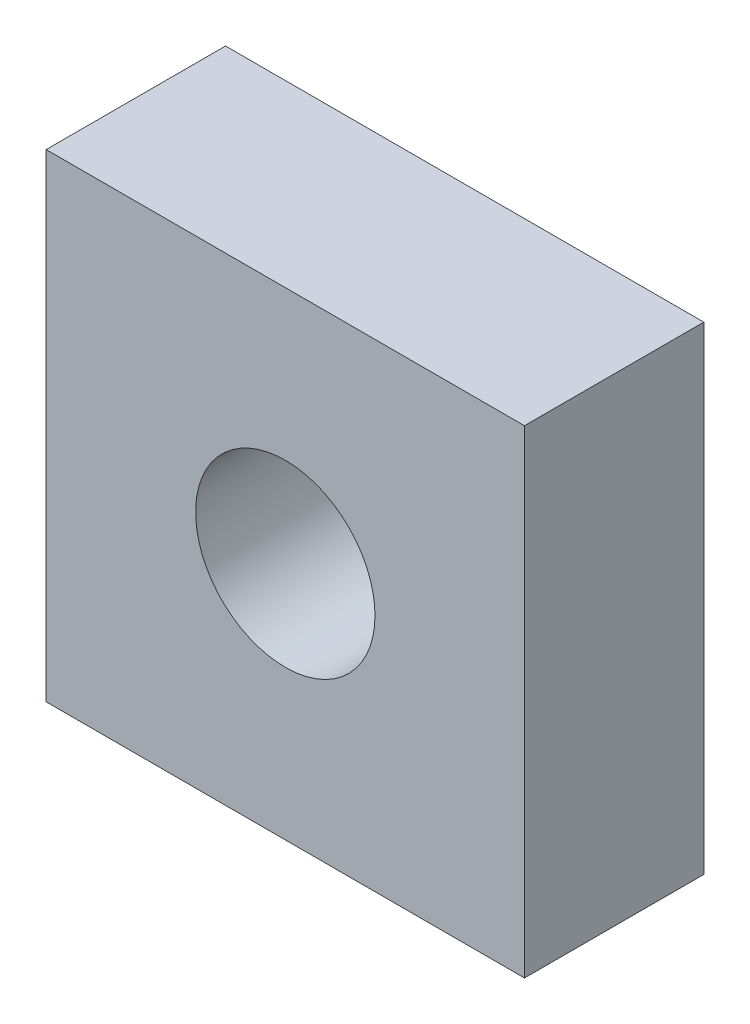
ISO-10303-21;
HEADER;
FILE_DESCRIPTION(('STEP AP214'),'2;1');
FILE_NAME('part.step','',(''),(''),'','','');
FILE_SCHEMA(('AUTOMOTIVE_DESIGN { 1 0 10303 214 1 1 1 1 }'));
ENDSEC;
DATA;
#1=APPLICATION_CONTEXT('core data for automotive mechanical design processes');
#2=APPLICATION_PROTOCOL_DEFINITION('international standard','automotive_design',2000,#1);
#3=PRODUCT_CONTEXT('',#1,'mechanical');
#4=PRODUCT('Part','Part','',(#3));
#5=PRODUCT_RELATED_PRODUCT_CATEGORY('part','',(#4));
#6=PRODUCT_DEFINITION_FORMATION('','',#4);
#7=PRODUCT_DEFINITION_CONTEXT('part definition',#1,'design');
#8=PRODUCT_DEFINITION('design','',#6,#7);
#9=PRODUCT_DEFINITION_SHAPE('','',#8);
#10=(LENGTH_UNIT() NAMED_UNIT(*) SI_UNIT(.MILLI.,.METRE.));
#11=(NAMED_UNIT(*) PLANE_ANGLE_UNIT() SI_UNIT($,.RADIAN.));
#12=(NAMED_UNIT(*) SI_UNIT($,.STERADIAN.) SOLID_ANGLE_UNIT());
#13=UNCERTAINTY_MEASURE_WITH_UNIT(LENGTH_MEASURE(1.E-05),#10,'distance_accuracy_value','');
#14=(GEOMETRIC_REPRESENTATION_CONTEXT(3) GLOBAL_UNCERTAINTY_ASSIGNED_CONTEXT((#13)) GLOBAL_UNIT_ASSIGNED_CONTEXT((#10,
#11,#12)) REPRESENTATION_CONTEXT('',''));
#15=CARTESIAN_POINT('',(0.,0.,0.));
#16=DIRECTION('',(0.,0.,1.));
#17=DIRECTION('',(1.,0.,0.));
#18=AXIS2_PLACEMENT_3D('',#15,#16,#17);
#19=CARTESIAN_POINT('',(-4.,-4.,3.));
#20=DIRECTION('',(0.,0.,1.));
#21=DIRECTION('',(1.,0.,0.));
#22=AXIS2_PLACEMENT_3D('',#19,#20,#21);
#23=PLANE('',#22);
#24=DIRECTION('',(0.,-1.,0.));
#25=VECTOR('',#24,1.);
#26=CARTESIAN_POINT('',(-4.,3.99999999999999,3.));
#27=LINE('',#26,#25);
#28=CARTESIAN_POINT('',(-4.,3.99999999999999,3.));
#29=VERTEX_POINT('',#28);
#30=CARTESIAN_POINT('',(-4.,-4.,3.));
#31=VERTEX_POINT('',#30);
#32=EDGE_CURVE('E95',#29,#31,#27,.T.);
#33=ORIENTED_EDGE('',*,*,#32,.T.);
#34=DIRECTION('',(1.,0.,0.));
#35=VECTOR('',#34,1.);
#36=CARTESIAN_POINT('',(-4.,-4.,3.));
#37=LINE('',#36,#35);
#38=CARTESIAN_POINT('',(4.,-4.,3.));
#39=VERTEX_POINT('',#38);
#40=EDGE_CURVE('E80',#31,#39,#37,.T.);
#41=ORIENTED_EDGE('',*,*,#40,.T.);
#42=DIRECTION('',(0.,1.,0.));
#43=VECTOR('',#42,1.);
#44=CARTESIAN_POINT('',(4.,3.99999999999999,3.));
#45=LINE('',#44,#43);
#46=CARTESIAN_POINT('',(4.,3.99999999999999,3.));
#47=VERTEX_POINT('',#46);
#48=EDGE_CURVE('E46',#39,#47,#45,.T.);
#49=ORIENTED_EDGE('',*,*,#48,.T.);
#50=DIRECTION('',(-1.,0.,0.));
#51=VECTOR('',#50,1.);
#52=CARTESIAN_POINT('',(-4.,3.99999999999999,3.));
#53=LINE('',#52,#51);
#54=EDGE_CURVE('E41',#47,#29,#53,.T.);
#55=ORIENTED_EDGE('',*,*,#54,.T.);
#56=EDGE_LOOP('',(#33,#41,#49,#55));
#57=FACE_BOUND('',#56,.T.);
#58=CARTESIAN_POINT('',(0.,0.,3.));
#59=DIRECTION('',(0.,0.,1.));
#60=DIRECTION('',(1.,0.,0.));
#61=AXIS2_PLACEMENT_3D('',#58,#59,#60);
#62=CIRCLE('',#61,1.5);
#63=CARTESIAN_POINT('',(1.5,0.,3.));
#64=VERTEX_POINT('',#63);
#65=EDGE_CURVE('E85',#64,#64,#62,.T.);
#66=ORIENTED_EDGE('',*,*,#65,.F.);
#67=EDGE_LOOP('',(#66));
#68=FACE_BOUND('',#67,.T.);
#69=ADVANCED_FACE('F26',(#57,#68),#23,.T.);
#70=CARTESIAN_POINT('',(-4.,-4.,0.));
#71=DIRECTION('',(0.,0.,1.));
#72=DIRECTION('',(1.,0.,0.));
#73=AXIS2_PLACEMENT_3D('',#70,#71,#72);
#74=PLANE('',#73);
#75=DIRECTION('',(0.,-1.,0.));
#76=VECTOR('',#75,1.);
#77=CARTESIAN_POINT('',(-4.,3.99999999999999,0.));
#78=LINE('',#77,#76);
#79=CARTESIAN_POINT('',(-4.,3.99999999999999,0.));
#80=VERTEX_POINT('',#79);
#81=CARTESIAN_POINT('',(-4.,-4.,0.));
#82=VERTEX_POINT('',#81);
#83=EDGE_CURVE('E72',#80,#82,#78,.T.);
#84=ORIENTED_EDGE('',*,*,#83,.F.);
#85=DIRECTION('',(-1.,0.,0.));
#86=VECTOR('',#85,1.);
#87=CARTESIAN_POINT('',(-4.,3.99999999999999,0.));
#88=LINE('',#87,#86);
#89=CARTESIAN_POINT('',(4.,3.99999999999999,0.));
#90=VERTEX_POINT('',#89);
#91=EDGE_CURVE('E93',#90,#80,#88,.T.);
#92=ORIENTED_EDGE('',*,*,#91,.F.);
#93=DIRECTION('',(0.,1.,0.));
#94=VECTOR('',#93,1.);
#95=CARTESIAN_POINT('',(4.,3.99999999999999,0.));
#96=LINE('',#95,#94);
#97=CARTESIAN_POINT('',(4.,-4.,0.));
#98=VERTEX_POINT('',#97);
#99=EDGE_CURVE('E73',#98,#90,#96,.T.);
#100=ORIENTED_EDGE('',*,*,#99,.F.);
#101=DIRECTION('',(1.,0.,0.));
#102=VECTOR('',#101,1.);
#103=CARTESIAN_POINT('',(-4.,-4.,0.));
#104=LINE('',#103,#102);
#105=EDGE_CURVE('E67',#82,#98,#104,.T.);
#106=ORIENTED_EDGE('',*,*,#105,.F.);
#107=EDGE_LOOP('',(#84,#92,#100,#106));
#108=FACE_BOUND('',#107,.T.);
#109=CARTESIAN_POINT('',(0.,0.,0.));
#110=DIRECTION('',(0.,0.,1.));
#111=DIRECTION('',(1.,0.,0.));
#112=AXIS2_PLACEMENT_3D('',#109,#110,#111);
#113=CIRCLE('',#112,1.5);
#114=CARTESIAN_POINT('',(1.5,0.,0.));
#115=VERTEX_POINT('',#114);
#116=EDGE_CURVE('E88',#115,#115,#113,.T.);
#117=ORIENTED_EDGE('',*,*,#116,.T.);
#118=EDGE_LOOP('',(#117));
#119=FACE_BOUND('',#118,.T.);
#120=ADVANCED_FACE('F68',(#108,#119),#74,.F.);
#121=CARTESIAN_POINT('',(-4.,3.99999999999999,3.));
#122=DIRECTION('',(1.,0.,0.));
#123=DIRECTION('',(0.,1.,0.));
#124=AXIS2_PLACEMENT_3D('',#121,#122,#123);
#125=PLANE('',#124);
#126=ORIENTED_EDGE('',*,*,#83,.T.);
#127=DIRECTION('',(0.,0.,-1.));
#128=VECTOR('',#127,1.);
#129=CARTESIAN_POINT('',(-4.,-4.,3.));
#130=LINE('',#129,#128);
#131=EDGE_CURVE('E11',#31,#82,#130,.T.);
#132=ORIENTED_EDGE('',*,*,#131,.F.);
#133=ORIENTED_EDGE('',*,*,#32,.F.);
#134=DIRECTION('',(0.,0.,-1.));
#135=VECTOR('',#134,1.);
#136=CARTESIAN_POINT('',(-4.,3.99999999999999,3.));
#137=LINE('',#136,#135);
#138=EDGE_CURVE('E84',#29,#80,#137,.T.);
#139=ORIENTED_EDGE('',*,*,#138,.T.);
#140=EDGE_LOOP('',(#126,#132,#133,#139));
#141=FACE_BOUND('',#140,.T.);
#142=ADVANCED_FACE('F28',(#141),#125,.F.);
#143=CARTESIAN_POINT('',(-4.,-4.,3.));
#144=DIRECTION('',(0.,1.,0.));
#145=DIRECTION('',(0.,0.,1.));
#146=AXIS2_PLACEMENT_3D('',#143,#144,#145);
#147=PLANE('',#146);
#148=ORIENTED_EDGE('',*,*,#105,.T.);
#149=DIRECTION('',(0.,0.,-1.));
#150=VECTOR('',#149,1.);
#151=CARTESIAN_POINT('',(4.,-4.,3.));
#152=LINE('',#151,#150);
#153=EDGE_CURVE('E34',#39,#98,#152,.T.);
#154=ORIENTED_EDGE('',*,*,#153,.F.);
#155=ORIENTED_EDGE('',*,*,#40,.F.);
#156=ORIENTED_EDGE('',*,*,#131,.T.);
#157=EDGE_LOOP('',(#148,#154,#155,#156));
#158=FACE_BOUND('',#157,.T.);
#159=ADVANCED_FACE('F79',(#158),#147,.F.);
#160=CARTESIAN_POINT('',(4.,3.99999999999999,3.));
#161=DIRECTION('',(-1.,0.,0.));
#162=DIRECTION('',(0.,-1.,0.));
#163=AXIS2_PLACEMENT_3D('',#160,#161,#162);
#164=PLANE('',#163);
#165=ORIENTED_EDGE('',*,*,#99,.T.);
#166=DIRECTION('',(0.,0.,-1.));
#167=VECTOR('',#166,1.);
#168=CARTESIAN_POINT('',(4.,3.99999999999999,3.));
#169=LINE('',#168,#167);
#170=EDGE_CURVE('E101',#47,#90,#169,.T.);
#171=ORIENTED_EDGE('',*,*,#170,.F.);
#172=ORIENTED_EDGE('',*,*,#48,.F.);
#173=ORIENTED_EDGE('',*,*,#153,.T.);
#174=EDGE_LOOP('',(#165,#171,#172,#173));
#175=FACE_BOUND('',#174,.T.);
#176=ADVANCED_FACE('F104',(#175),#164,.F.);
#177=CARTESIAN_POINT('',(-4.,3.99999999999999,3.));
#178=DIRECTION('',(0.,-1.,0.));
#179=DIRECTION('',(0.,0.,-1.));
#180=AXIS2_PLACEMENT_3D('',#177,#178,#179);
#181=PLANE('',#180);
#182=ORIENTED_EDGE('',*,*,#91,.T.);
#183=ORIENTED_EDGE('',*,*,#138,.F.);
#184=ORIENTED_EDGE('',*,*,#54,.F.);
#185=ORIENTED_EDGE('',*,*,#170,.T.);
#186=EDGE_LOOP('',(#182,#183,#184,#185));
#187=FACE_BOUND('',#186,.T.);
#188=ADVANCED_FACE('F106',(#187),#181,.F.);
#189=CARTESIAN_POINT('',(0.,0.,3.));
#190=DIRECTION('',(0.,0.,-1.));
#191=DIRECTION('',(-1.,0.,0.));
#192=AXIS2_PLACEMENT_3D('',#189,#190,#191);
#193=CYLINDRICAL_SURFACE('',#192,1.5);
#194=ORIENTED_EDGE('',*,*,#65,.T.);
#195=EDGE_LOOP('',(#194));
#196=FACE_BOUND('',#195,.T.);
#197=ORIENTED_EDGE('',*,*,#116,.F.);
#198=EDGE_LOOP('',(#197));
#199=FACE_BOUND('',#198,.T.);
#200=ADVANCED_FACE('F112',(#196,#199),#193,.F.);
#201=CLOSED_SHELL('',(#69,#120,#142,#159,#176,#188,#200));
#202=MANIFOLD_SOLID_BREP('B2',#201);
#203=ADVANCED_BREP_SHAPE_REPRESENTATION('',(#18,#202),#14);
#204=SHAPE_DEFINITION_REPRESENTATION(#9,#203);
ENDSEC;
END-ISO-10303-21;
